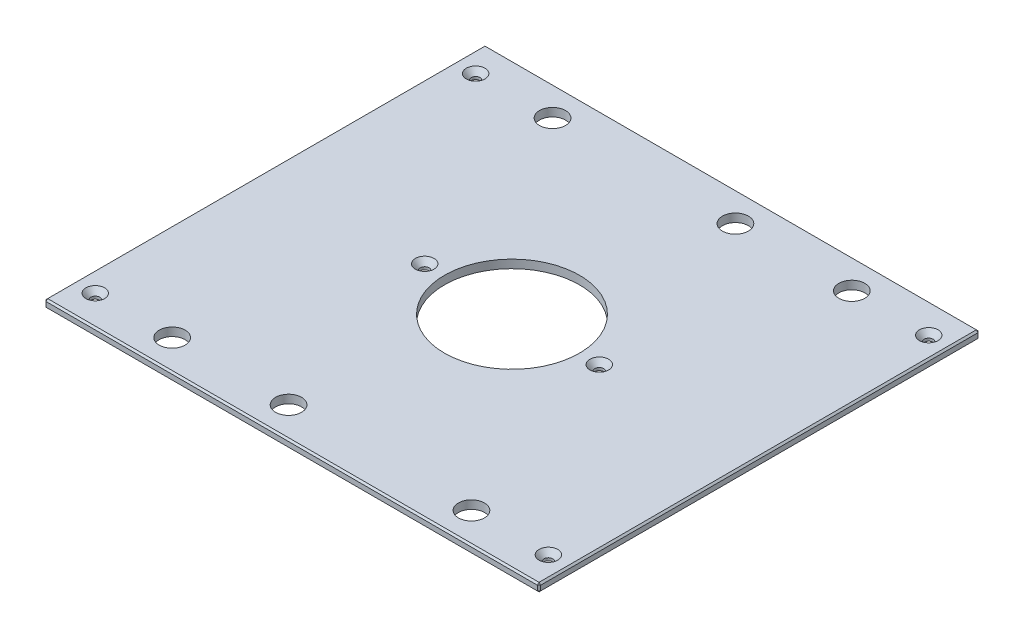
ISO-10303-21;
HEADER;
FILE_DESCRIPTION(('STEP AP214'),'2;1');
FILE_NAME('part.step','',(''),(''),'','','');
FILE_SCHEMA(('AUTOMOTIVE_DESIGN { 1 0 10303 214 1 1 1 1 }'));
ENDSEC;
DATA;
#1=APPLICATION_CONTEXT('core data for automotive mechanical design processes');
#2=APPLICATION_PROTOCOL_DEFINITION('international standard','automotive_design',2000,#1);
#3=PRODUCT_CONTEXT('',#1,'mechanical');
#4=PRODUCT('Part','Part','',(#3));
#5=PRODUCT_RELATED_PRODUCT_CATEGORY('part','',(#4));
#6=PRODUCT_DEFINITION_FORMATION('','',#4);
#7=PRODUCT_DEFINITION_CONTEXT('part definition',#1,'design');
#8=PRODUCT_DEFINITION('design','',#6,#7);
#9=PRODUCT_DEFINITION_SHAPE('','',#8);
#10=(LENGTH_UNIT() NAMED_UNIT(*) SI_UNIT(.MILLI.,.METRE.));
#11=(NAMED_UNIT(*) PLANE_ANGLE_UNIT() SI_UNIT($,.RADIAN.));
#12=(NAMED_UNIT(*) SI_UNIT($,.STERADIAN.) SOLID_ANGLE_UNIT());
#13=UNCERTAINTY_MEASURE_WITH_UNIT(LENGTH_MEASURE(1.E-05),#10,'distance_accuracy_value','');
#14=(GEOMETRIC_REPRESENTATION_CONTEXT(3) GLOBAL_UNCERTAINTY_ASSIGNED_CONTEXT((#13)) GLOBAL_UNIT_ASSIGNED_CONTEXT((#10,
#11,#12)) REPRESENTATION_CONTEXT('',''));
#15=CARTESIAN_POINT('',(0.,0.,0.));
#16=DIRECTION('',(0.,0.,1.));
#17=DIRECTION('',(1.,0.,0.));
#18=AXIS2_PLACEMENT_3D('',#15,#16,#17);
#19=CARTESIAN_POINT('',(-188.9125,6.35,-168.275));
#20=DIRECTION('',(1.,0.,0.));
#21=DIRECTION('',(0.,0.,-1.));
#22=AXIS2_PLACEMENT_3D('',#19,#20,#21);
#23=PLANE('',#22);
#24=DIRECTION('',(0.,0.,-1.));
#25=VECTOR('',#24,1.);
#26=CARTESIAN_POINT('',(-188.9125,5.08000000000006,-168.275));
#27=LINE('',#26,#25);
#28=CARTESIAN_POINT('',(-188.9125,5.08000000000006,167.005));
#29=VERTEX_POINT('',#28);
#30=CARTESIAN_POINT('',(-188.9125,5.08000000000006,-167.005));
#31=VERTEX_POINT('',#30);
#32=EDGE_CURVE('E134',#29,#31,#27,.T.);
#33=ORIENTED_EDGE('',*,*,#32,.T.);
#34=DIRECTION('',(0.,-1.,0.));
#35=VECTOR('',#34,1.);
#36=CARTESIAN_POINT('',(-188.9125,6.35,-167.005));
#37=LINE('',#36,#35);
#38=CARTESIAN_POINT('',(-188.9125,1.26999999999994,-167.005));
#39=VERTEX_POINT('',#38);
#40=EDGE_CURVE('E130',#31,#39,#37,.T.);
#41=ORIENTED_EDGE('',*,*,#40,.T.);
#42=DIRECTION('',(0.,0.,1.));
#43=VECTOR('',#42,1.);
#44=CARTESIAN_POINT('',(-188.9125,1.26999999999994,-168.275));
#45=LINE('',#44,#43);
#46=CARTESIAN_POINT('',(-188.9125,1.26999999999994,167.005));
#47=VERTEX_POINT('',#46);
#48=EDGE_CURVE('E125',#39,#47,#45,.T.);
#49=ORIENTED_EDGE('',*,*,#48,.T.);
#50=DIRECTION('',(0.,1.,0.));
#51=VECTOR('',#50,1.);
#52=CARTESIAN_POINT('',(-188.9125,6.35,167.005));
#53=LINE('',#52,#51);
#54=EDGE_CURVE('E127',#47,#29,#53,.T.);
#55=ORIENTED_EDGE('',*,*,#54,.T.);
#56=EDGE_LOOP('',(#33,#41,#49,#55));
#57=FACE_BOUND('',#56,.T.);
#58=ADVANCED_FACE('F34',(#57),#23,.F.);
#59=CARTESIAN_POINT('',(-188.9125,6.35,168.275));
#60=DIRECTION('',(0.,0.,-1.));
#61=DIRECTION('',(-1.,0.,0.));
#62=AXIS2_PLACEMENT_3D('',#59,#60,#61);
#63=PLANE('',#62);
#64=DIRECTION('',(1.,0.,0.));
#65=VECTOR('',#64,1.);
#66=CARTESIAN_POINT('',(-188.9125,1.26999999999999,168.275));
#67=LINE('',#66,#65);
#68=CARTESIAN_POINT('',(-187.6425,1.26999999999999,168.275));
#69=VERTEX_POINT('',#68);
#70=CARTESIAN_POINT('',(187.6425,1.26999999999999,168.275));
#71=VERTEX_POINT('',#70);
#72=EDGE_CURVE('E57',#69,#71,#67,.T.);
#73=ORIENTED_EDGE('',*,*,#72,.T.);
#74=DIRECTION('',(0.,1.,0.));
#75=VECTOR('',#74,1.);
#76=CARTESIAN_POINT('',(187.6425,6.35,168.275));
#77=LINE('',#76,#75);
#78=CARTESIAN_POINT('',(187.6425,5.08000000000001,168.275));
#79=VERTEX_POINT('',#78);
#80=EDGE_CURVE('E11',#71,#79,#77,.T.);
#81=ORIENTED_EDGE('',*,*,#80,.T.);
#82=DIRECTION('',(-1.,0.,0.));
#83=VECTOR('',#82,1.);
#84=CARTESIAN_POINT('',(-188.9125,5.08000000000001,168.275));
#85=LINE('',#84,#83);
#86=CARTESIAN_POINT('',(-187.6425,5.08000000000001,168.275));
#87=VERTEX_POINT('',#86);
#88=EDGE_CURVE('E43',#79,#87,#85,.T.);
#89=ORIENTED_EDGE('',*,*,#88,.T.);
#90=DIRECTION('',(0.,-1.,0.));
#91=VECTOR('',#90,1.);
#92=CARTESIAN_POINT('',(-187.6425,6.35,168.275));
#93=LINE('',#92,#91);
#94=EDGE_CURVE('E290',#87,#69,#93,.T.);
#95=ORIENTED_EDGE('',*,*,#94,.T.);
#96=EDGE_LOOP('',(#73,#81,#89,#95));
#97=FACE_BOUND('',#96,.T.);
#98=ADVANCED_FACE('F359',(#97),#63,.F.);
#99=CARTESIAN_POINT('',(188.9125,6.35,-168.275));
#100=DIRECTION('',(-1.,0.,0.));
#101=DIRECTION('',(0.,0.,1.));
#102=AXIS2_PLACEMENT_3D('',#99,#100,#101);
#103=PLANE('',#102);
#104=DIRECTION('',(0.,0.,-1.));
#105=VECTOR('',#104,1.);
#106=CARTESIAN_POINT('',(188.9125,1.26999999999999,-168.275));
#107=LINE('',#106,#105);
#108=CARTESIAN_POINT('',(188.9125,1.26999999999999,167.005));
#109=VERTEX_POINT('',#108);
#110=CARTESIAN_POINT('',(188.9125,1.26999999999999,-167.005));
#111=VERTEX_POINT('',#110);
#112=EDGE_CURVE('E285',#109,#111,#107,.T.);
#113=ORIENTED_EDGE('',*,*,#112,.T.);
#114=DIRECTION('',(0.,1.,0.));
#115=VECTOR('',#114,1.);
#116=CARTESIAN_POINT('',(188.9125,6.35,-167.005));
#117=LINE('',#116,#115);
#118=CARTESIAN_POINT('',(188.9125,5.08000000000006,-167.005));
#119=VERTEX_POINT('',#118);
#120=EDGE_CURVE('E287',#111,#119,#117,.T.);
#121=ORIENTED_EDGE('',*,*,#120,.T.);
#122=DIRECTION('',(0.,0.,1.));
#123=VECTOR('',#122,1.);
#124=CARTESIAN_POINT('',(188.9125,5.08000000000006,168.275));
#125=LINE('',#124,#123);
#126=CARTESIAN_POINT('',(188.9125,5.08000000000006,167.005));
#127=VERTEX_POINT('',#126);
#128=EDGE_CURVE('E283',#119,#127,#125,.T.);
#129=ORIENTED_EDGE('',*,*,#128,.T.);
#130=DIRECTION('',(0.,-1.,0.));
#131=VECTOR('',#130,1.);
#132=CARTESIAN_POINT('',(188.9125,6.35,167.005));
#133=LINE('',#132,#131);
#134=EDGE_CURVE('E281',#127,#109,#133,.T.);
#135=ORIENTED_EDGE('',*,*,#134,.T.);
#136=EDGE_LOOP('',(#113,#121,#129,#135));
#137=FACE_BOUND('',#136,.T.);
#138=ADVANCED_FACE('F346',(#137),#103,.F.);
#139=CARTESIAN_POINT('',(-188.9125,6.35,-168.275));
#140=DIRECTION('',(0.,0.,1.));
#141=DIRECTION('',(1.,0.,0.));
#142=AXIS2_PLACEMENT_3D('',#139,#140,#141);
#143=PLANE('',#142);
#144=DIRECTION('',(-1.,0.,0.));
#145=VECTOR('',#144,1.);
#146=CARTESIAN_POINT('',(-188.9125,1.26999999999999,-168.275));
#147=LINE('',#146,#145);
#148=CARTESIAN_POINT('',(187.6425,1.26999999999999,-168.275));
#149=VERTEX_POINT('',#148);
#150=CARTESIAN_POINT('',(-187.6425,1.26999999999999,-168.275));
#151=VERTEX_POINT('',#150);
#152=EDGE_CURVE('E257',#149,#151,#147,.T.);
#153=ORIENTED_EDGE('',*,*,#152,.T.);
#154=DIRECTION('',(0.,1.,0.));
#155=VECTOR('',#154,1.);
#156=CARTESIAN_POINT('',(-187.6425,6.35,-168.275));
#157=LINE('',#156,#155);
#158=CARTESIAN_POINT('',(-187.6425,5.08000000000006,-168.275));
#159=VERTEX_POINT('',#158);
#160=EDGE_CURVE('E261',#151,#159,#157,.T.);
#161=ORIENTED_EDGE('',*,*,#160,.T.);
#162=DIRECTION('',(1.,0.,0.));
#163=VECTOR('',#162,1.);
#164=CARTESIAN_POINT('',(188.9125,5.08000000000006,-168.275));
#165=LINE('',#164,#163);
#166=CARTESIAN_POINT('',(187.6425,5.08000000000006,-168.275));
#167=VERTEX_POINT('',#166);
#168=EDGE_CURVE('E259',#159,#167,#165,.T.);
#169=ORIENTED_EDGE('',*,*,#168,.T.);
#170=DIRECTION('',(0.,-1.,0.));
#171=VECTOR('',#170,1.);
#172=CARTESIAN_POINT('',(187.6425,6.35,-168.275));
#173=LINE('',#172,#171);
#174=EDGE_CURVE('E255',#167,#149,#173,.T.);
#175=ORIENTED_EDGE('',*,*,#174,.T.);
#176=EDGE_LOOP('',(#153,#161,#169,#175));
#177=FACE_BOUND('',#176,.T.);
#178=ADVANCED_FACE('F320',(#177),#143,.F.);
#179=CARTESIAN_POINT('',(0.,6.35,0.));
#180=DIRECTION('',(0.,1.,0.));
#181=DIRECTION('',(0.,0.,1.));
#182=AXIS2_PLACEMENT_3D('',#179,#180,#181);
#183=PLANE('',#182);
#184=CARTESIAN_POINT('',(173.0375,6.35,-145.25498));
#185=DIRECTION('',(0.,1.,0.));
#186=DIRECTION('',(0.,0.,1.));
#187=AXIS2_PLACEMENT_3D('',#184,#185,#186);
#188=CIRCLE('',#187,7.13739999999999);
#189=CARTESIAN_POINT('',(173.0375,6.35,-138.11758));
#190=VERTEX_POINT('',#189);
#191=EDGE_CURVE('E783',#190,#190,#188,.T.);
#192=ORIENTED_EDGE('',*,*,#191,.F.);
#193=EDGE_LOOP('',(#192));
#194=FACE_BOUND('',#193,.T.);
#195=CARTESIAN_POINT('',(173.0375,6.35,145.25498));
#196=DIRECTION('',(0.,1.,0.));
#197=DIRECTION('',(0.,0.,1.));
#198=AXIS2_PLACEMENT_3D('',#195,#196,#197);
#199=CIRCLE('',#198,7.13739999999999);
#200=CARTESIAN_POINT('',(173.0375,6.35,152.39238));
#201=VERTEX_POINT('',#200);
#202=EDGE_CURVE('E787',#201,#201,#199,.T.);
#203=ORIENTED_EDGE('',*,*,#202,.F.);
#204=EDGE_LOOP('',(#203));
#205=FACE_BOUND('',#204,.T.);
#206=CARTESIAN_POINT('',(-173.0375,6.35,145.25498));
#207=DIRECTION('',(0.,1.,0.));
#208=DIRECTION('',(0.,0.,1.));
#209=AXIS2_PLACEMENT_3D('',#206,#207,#208);
#210=CIRCLE('',#209,7.13739999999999);
#211=CARTESIAN_POINT('',(-173.0375,6.35,152.39238));
#212=VERTEX_POINT('',#211);
#213=EDGE_CURVE('E791',#212,#212,#210,.T.);
#214=ORIENTED_EDGE('',*,*,#213,.F.);
#215=EDGE_LOOP('',(#214));
#216=FACE_BOUND('',#215,.T.);
#217=CARTESIAN_POINT('',(-66.675,6.35,0.));
#218=DIRECTION('',(0.,1.,0.));
#219=DIRECTION('',(0.,0.,1.));
#220=AXIS2_PLACEMENT_3D('',#217,#218,#219);
#221=CIRCLE('',#220,7.1374);
#222=CARTESIAN_POINT('',(-66.675,6.35,7.1374));
#223=VERTEX_POINT('',#222);
#224=EDGE_CURVE('E795',#223,#223,#221,.T.);
#225=ORIENTED_EDGE('',*,*,#224,.F.);
#226=EDGE_LOOP('',(#225));
#227=FACE_BOUND('',#226,.T.);
#228=CARTESIAN_POINT('',(66.675,6.35,0.));
#229=DIRECTION('',(0.,1.,0.));
#230=DIRECTION('',(0.,0.,1.));
#231=AXIS2_PLACEMENT_3D('',#228,#229,#230);
#232=CIRCLE('',#231,7.1374);
#233=CARTESIAN_POINT('',(66.675,6.35,7.1374));
#234=VERTEX_POINT('',#233);
#235=EDGE_CURVE('E799',#234,#234,#232,.T.);
#236=ORIENTED_EDGE('',*,*,#235,.F.);
#237=EDGE_LOOP('',(#236));
#238=FACE_BOUND('',#237,.T.);
#239=CARTESIAN_POINT('',(-173.0375,6.35,-145.25498));
#240=DIRECTION('',(0.,1.,0.));
#241=DIRECTION('',(0.,0.,1.));
#242=AXIS2_PLACEMENT_3D('',#239,#240,#241);
#243=CIRCLE('',#242,7.13739999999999);
#244=CARTESIAN_POINT('',(-173.0375,6.35,-138.11758));
#245=VERTEX_POINT('',#244);
#246=EDGE_CURVE('E802',#245,#245,#243,.T.);
#247=ORIENTED_EDGE('',*,*,#246,.F.);
#248=EDGE_LOOP('',(#247));
#249=FACE_BOUND('',#248,.T.);
#250=DIRECTION('',(0.,0.,-1.));
#251=VECTOR('',#250,1.);
#252=CARTESIAN_POINT('',(187.6425,6.35,-168.275));
#253=LINE('',#252,#251);
#254=CARTESIAN_POINT('',(187.6425,6.35,167.005));
#255=VERTEX_POINT('',#254);
#256=CARTESIAN_POINT('',(187.6425,6.35,-167.005));
#257=VERTEX_POINT('',#256);
#258=EDGE_CURVE('E268',#255,#257,#253,.T.);
#259=ORIENTED_EDGE('',*,*,#258,.T.);
#260=DIRECTION('',(-1.,0.,0.));
#261=VECTOR('',#260,1.);
#262=CARTESIAN_POINT('',(-188.9125,6.35,-167.005));
#263=LINE('',#262,#261);
#264=CARTESIAN_POINT('',(-187.6425,6.35,-167.005));
#265=VERTEX_POINT('',#264);
#266=EDGE_CURVE('E270',#257,#265,#263,.T.);
#267=ORIENTED_EDGE('',*,*,#266,.T.);
#268=DIRECTION('',(0.,0.,1.));
#269=VECTOR('',#268,1.);
#270=CARTESIAN_POINT('',(-187.6425,6.35,168.275));
#271=LINE('',#270,#269);
#272=CARTESIAN_POINT('',(-187.6425,6.35,167.005));
#273=VERTEX_POINT('',#272);
#274=EDGE_CURVE('E266',#265,#273,#271,.T.);
#275=ORIENTED_EDGE('',*,*,#274,.T.);
#276=DIRECTION('',(1.,0.,0.));
#277=VECTOR('',#276,1.);
#278=CARTESIAN_POINT('',(188.9125,6.35,167.005));
#279=LINE('',#278,#277);
#280=EDGE_CURVE('E264',#273,#255,#279,.T.);
#281=ORIENTED_EDGE('',*,*,#280,.T.);
#282=EDGE_LOOP('',(#259,#267,#275,#281));
#283=FACE_BOUND('',#282,.T.);
#284=CARTESIAN_POINT('',(114.3,6.35,-145.25498));
#285=DIRECTION('',(0.,1.,0.));
#286=DIRECTION('',(0.,0.,1.));
#287=AXIS2_PLACEMENT_3D('',#284,#285,#286);
#288=CIRCLE('',#287,9.921875);
#289=CARTESIAN_POINT('',(114.3,6.35,-135.333105));
#290=VERTEX_POINT('',#289);
#291=EDGE_CURVE('E203',#290,#290,#288,.T.);
#292=ORIENTED_EDGE('',*,*,#291,.F.);
#293=EDGE_LOOP('',(#292));
#294=FACE_BOUND('',#293,.T.);
#295=CARTESIAN_POINT('',(-114.3,6.35,-145.25498));
#296=DIRECTION('',(0.,1.,0.));
#297=DIRECTION('',(0.,0.,1.));
#298=AXIS2_PLACEMENT_3D('',#295,#296,#297);
#299=CIRCLE('',#298,9.921875);
#300=CARTESIAN_POINT('',(-114.3,6.35,-135.333105));
#301=VERTEX_POINT('',#300);
#302=EDGE_CURVE('E213',#301,#301,#299,.T.);
#303=ORIENTED_EDGE('',*,*,#302,.F.);
#304=EDGE_LOOP('',(#303));
#305=FACE_BOUND('',#304,.T.);
#306=CARTESIAN_POINT('',(114.3,6.35,145.25498));
#307=DIRECTION('',(0.,1.,0.));
#308=DIRECTION('',(0.,0.,1.));
#309=AXIS2_PLACEMENT_3D('',#306,#307,#308);
#310=CIRCLE('',#309,9.921875);
#311=CARTESIAN_POINT('',(114.3,6.35,155.176855));
#312=VERTEX_POINT('',#311);
#313=EDGE_CURVE('E224',#312,#312,#310,.T.);
#314=ORIENTED_EDGE('',*,*,#313,.F.);
#315=EDGE_LOOP('',(#314));
#316=FACE_BOUND('',#315,.T.);
#317=CARTESIAN_POINT('',(-114.3,6.35,145.25498));
#318=DIRECTION('',(0.,1.,0.));
#319=DIRECTION('',(0.,0.,1.));
#320=AXIS2_PLACEMENT_3D('',#317,#318,#319);
#321=CIRCLE('',#320,9.921875);
#322=CARTESIAN_POINT('',(-114.3,6.35,155.176855));
#323=VERTEX_POINT('',#322);
#324=EDGE_CURVE('E230',#323,#323,#321,.T.);
#325=ORIENTED_EDGE('',*,*,#324,.F.);
#326=EDGE_LOOP('',(#325));
#327=FACE_BOUND('',#326,.T.);
#328=CARTESIAN_POINT('',(25.4,6.35,-145.25498));
#329=DIRECTION('',(0.,1.,0.));
#330=DIRECTION('',(0.,0.,1.));
#331=AXIS2_PLACEMENT_3D('',#328,#329,#330);
#332=CIRCLE('',#331,9.921875);
#333=CARTESIAN_POINT('',(25.4,6.35,-135.333105));
#334=VERTEX_POINT('',#333);
#335=EDGE_CURVE('E236',#334,#334,#332,.T.);
#336=ORIENTED_EDGE('',*,*,#335,.F.);
#337=EDGE_LOOP('',(#336));
#338=FACE_BOUND('',#337,.T.);
#339=CARTESIAN_POINT('',(-25.4,6.35,145.25498));
#340=DIRECTION('',(0.,1.,0.));
#341=DIRECTION('',(0.,0.,1.));
#342=AXIS2_PLACEMENT_3D('',#339,#340,#341);
#343=CIRCLE('',#342,9.921875);
#344=CARTESIAN_POINT('',(-25.4,6.35,155.176855));
#345=VERTEX_POINT('',#344);
#346=EDGE_CURVE('E242',#345,#345,#343,.T.);
#347=ORIENTED_EDGE('',*,*,#346,.F.);
#348=EDGE_LOOP('',(#347));
#349=FACE_BOUND('',#348,.T.);
#350=CARTESIAN_POINT('',(0.,6.35,0.));
#351=DIRECTION('',(0.,1.,0.));
#352=DIRECTION('',(0.,0.,1.));
#353=AXIS2_PLACEMENT_3D('',#350,#351,#352);
#354=CIRCLE('',#353,51.562);
#355=CARTESIAN_POINT('',(0.,6.35,51.562));
#356=VERTEX_POINT('',#355);
#357=EDGE_CURVE('E248',#356,#356,#354,.T.);
#358=ORIENTED_EDGE('',*,*,#357,.F.);
#359=EDGE_LOOP('',(#358));
#360=FACE_BOUND('',#359,.T.);
#361=ADVANCED_FACE('F368',(#194,#205,#216,#227,#238,#249,#283,#294,#305,#316,#327,#338,#349,
#360),#183,.T.);
#362=CARTESIAN_POINT('',(0.,0.,0.));
#363=DIRECTION('',(0.,1.,0.));
#364=DIRECTION('',(0.,0.,1.));
#365=AXIS2_PLACEMENT_3D('',#362,#363,#364);
#366=PLANE('',#365);
#367=CARTESIAN_POINT('',(173.0375,0.,-145.25498));
#368=DIRECTION('',(0.,1.,0.));
#369=DIRECTION('',(0.,0.,1.));
#370=AXIS2_PLACEMENT_3D('',#367,#368,#369);
#371=CIRCLE('',#370,3.3782);
#372=CARTESIAN_POINT('',(173.0375,0.,-141.87678));
#373=VERTEX_POINT('',#372);
#374=EDGE_CURVE('E836',#373,#373,#371,.T.);
#375=ORIENTED_EDGE('',*,*,#374,.T.);
#376=EDGE_LOOP('',(#375));
#377=FACE_BOUND('',#376,.T.);
#378=CARTESIAN_POINT('',(173.0375,0.,145.25498));
#379=DIRECTION('',(0.,1.,0.));
#380=DIRECTION('',(0.,0.,1.));
#381=AXIS2_PLACEMENT_3D('',#378,#379,#380);
#382=CIRCLE('',#381,3.3782);
#383=CARTESIAN_POINT('',(173.0375,0.,148.63318));
#384=VERTEX_POINT('',#383);
#385=EDGE_CURVE('E829',#384,#384,#382,.T.);
#386=ORIENTED_EDGE('',*,*,#385,.T.);
#387=EDGE_LOOP('',(#386));
#388=FACE_BOUND('',#387,.T.);
#389=CARTESIAN_POINT('',(-173.0375,0.,145.25498));
#390=DIRECTION('',(0.,1.,0.));
#391=DIRECTION('',(0.,0.,1.));
#392=AXIS2_PLACEMENT_3D('',#389,#390,#391);
#393=CIRCLE('',#392,3.3782);
#394=CARTESIAN_POINT('',(-173.0375,0.,148.63318));
#395=VERTEX_POINT('',#394);
#396=EDGE_CURVE('E822',#395,#395,#393,.T.);
#397=ORIENTED_EDGE('',*,*,#396,.T.);
#398=EDGE_LOOP('',(#397));
#399=FACE_BOUND('',#398,.T.);
#400=CARTESIAN_POINT('',(-66.675,0.,0.));
#401=DIRECTION('',(0.,1.,0.));
#402=DIRECTION('',(0.,0.,1.));
#403=AXIS2_PLACEMENT_3D('',#400,#401,#402);
#404=CIRCLE('',#403,3.3782);
#405=CARTESIAN_POINT('',(-66.675,0.,3.3782));
#406=VERTEX_POINT('',#405);
#407=EDGE_CURVE('E815',#406,#406,#404,.T.);
#408=ORIENTED_EDGE('',*,*,#407,.T.);
#409=EDGE_LOOP('',(#408));
#410=FACE_BOUND('',#409,.T.);
#411=CARTESIAN_POINT('',(66.675,0.,0.));
#412=DIRECTION('',(0.,1.,0.));
#413=DIRECTION('',(0.,0.,1.));
#414=AXIS2_PLACEMENT_3D('',#411,#412,#413);
#415=CIRCLE('',#414,3.3782);
#416=CARTESIAN_POINT('',(66.675,0.,3.3782));
#417=VERTEX_POINT('',#416);
#418=EDGE_CURVE('E805',#417,#417,#415,.T.);
#419=ORIENTED_EDGE('',*,*,#418,.T.);
#420=EDGE_LOOP('',(#419));
#421=FACE_BOUND('',#420,.T.);
#422=CARTESIAN_POINT('',(-173.0375,0.,-145.25498));
#423=DIRECTION('',(0.,1.,0.));
#424=DIRECTION('',(0.,0.,1.));
#425=AXIS2_PLACEMENT_3D('',#422,#423,#424);
#426=CIRCLE('',#425,3.3782);
#427=CARTESIAN_POINT('',(-173.0375,0.,-141.87678));
#428=VERTEX_POINT('',#427);
#429=EDGE_CURVE('E216',#428,#428,#426,.T.);
#430=ORIENTED_EDGE('',*,*,#429,.T.);
#431=EDGE_LOOP('',(#430));
#432=FACE_BOUND('',#431,.T.);
#433=DIRECTION('',(0.,0.,-1.));
#434=VECTOR('',#433,1.);
#435=CARTESIAN_POINT('',(-187.6425,0.,0.));
#436=LINE('',#435,#434);
#437=CARTESIAN_POINT('',(-187.6425,0.,167.005));
#438=VERTEX_POINT('',#437);
#439=CARTESIAN_POINT('',(-187.6425,0.,-167.005));
#440=VERTEX_POINT('',#439);
#441=EDGE_CURVE('E157',#438,#440,#436,.T.);
#442=ORIENTED_EDGE('',*,*,#441,.T.);
#443=DIRECTION('',(1.,0.,0.));
#444=VECTOR('',#443,1.);
#445=CARTESIAN_POINT('',(0.,0.,-167.005));
#446=LINE('',#445,#444);
#447=CARTESIAN_POINT('',(187.6425,0.,-167.005));
#448=VERTEX_POINT('',#447);
#449=EDGE_CURVE('E278',#440,#448,#446,.T.);
#450=ORIENTED_EDGE('',*,*,#449,.T.);
#451=DIRECTION('',(0.,0.,1.));
#452=VECTOR('',#451,1.);
#453=CARTESIAN_POINT('',(187.6425,0.,0.));
#454=LINE('',#453,#452);
#455=CARTESIAN_POINT('',(187.6425,0.,167.005));
#456=VERTEX_POINT('',#455);
#457=EDGE_CURVE('E276',#448,#456,#454,.T.);
#458=ORIENTED_EDGE('',*,*,#457,.T.);
#459=DIRECTION('',(-1.,0.,0.));
#460=VECTOR('',#459,1.);
#461=CARTESIAN_POINT('',(0.,0.,167.005));
#462=LINE('',#461,#460);
#463=EDGE_CURVE('E273',#456,#438,#462,.T.);
#464=ORIENTED_EDGE('',*,*,#463,.T.);
#465=EDGE_LOOP('',(#442,#450,#458,#464));
#466=FACE_BOUND('',#465,.T.);
#467=CARTESIAN_POINT('',(114.3,0.,-145.25498));
#468=DIRECTION('',(0.,1.,0.));
#469=DIRECTION('',(0.,0.,1.));
#470=AXIS2_PLACEMENT_3D('',#467,#468,#469);
#471=CIRCLE('',#470,9.921875);
#472=CARTESIAN_POINT('',(114.3,0.,-135.333105));
#473=VERTEX_POINT('',#472);
#474=EDGE_CURVE('E208',#473,#473,#471,.T.);
#475=ORIENTED_EDGE('',*,*,#474,.T.);
#476=EDGE_LOOP('',(#475));
#477=FACE_BOUND('',#476,.T.);
#478=CARTESIAN_POINT('',(-114.3,0.,-145.25498));
#479=DIRECTION('',(0.,1.,0.));
#480=DIRECTION('',(0.,0.,1.));
#481=AXIS2_PLACEMENT_3D('',#478,#479,#480);
#482=CIRCLE('',#481,9.921875);
#483=CARTESIAN_POINT('',(-114.3,0.,-135.333105));
#484=VERTEX_POINT('',#483);
#485=EDGE_CURVE('E221',#484,#484,#482,.T.);
#486=ORIENTED_EDGE('',*,*,#485,.T.);
#487=EDGE_LOOP('',(#486));
#488=FACE_BOUND('',#487,.T.);
#489=CARTESIAN_POINT('',(114.3,0.,145.25498));
#490=DIRECTION('',(0.,1.,0.));
#491=DIRECTION('',(0.,0.,1.));
#492=AXIS2_PLACEMENT_3D('',#489,#490,#491);
#493=CIRCLE('',#492,9.921875);
#494=CARTESIAN_POINT('',(114.3,0.,155.176855));
#495=VERTEX_POINT('',#494);
#496=EDGE_CURVE('E227',#495,#495,#493,.T.);
#497=ORIENTED_EDGE('',*,*,#496,.T.);
#498=EDGE_LOOP('',(#497));
#499=FACE_BOUND('',#498,.T.);
#500=CARTESIAN_POINT('',(-114.3,0.,145.25498));
#501=DIRECTION('',(0.,1.,0.));
#502=DIRECTION('',(0.,0.,1.));
#503=AXIS2_PLACEMENT_3D('',#500,#501,#502);
#504=CIRCLE('',#503,9.921875);
#505=CARTESIAN_POINT('',(-114.3,0.,155.176855));
#506=VERTEX_POINT('',#505);
#507=EDGE_CURVE('E233',#506,#506,#504,.T.);
#508=ORIENTED_EDGE('',*,*,#507,.T.);
#509=EDGE_LOOP('',(#508));
#510=FACE_BOUND('',#509,.T.);
#511=CARTESIAN_POINT('',(25.4,0.,-145.25498));
#512=DIRECTION('',(0.,1.,0.));
#513=DIRECTION('',(0.,0.,1.));
#514=AXIS2_PLACEMENT_3D('',#511,#512,#513);
#515=CIRCLE('',#514,9.921875);
#516=CARTESIAN_POINT('',(25.4,0.,-135.333105));
#517=VERTEX_POINT('',#516);
#518=EDGE_CURVE('E239',#517,#517,#515,.T.);
#519=ORIENTED_EDGE('',*,*,#518,.T.);
#520=EDGE_LOOP('',(#519));
#521=FACE_BOUND('',#520,.T.);
#522=CARTESIAN_POINT('',(-25.4,0.,145.25498));
#523=DIRECTION('',(0.,1.,0.));
#524=DIRECTION('',(0.,0.,1.));
#525=AXIS2_PLACEMENT_3D('',#522,#523,#524);
#526=CIRCLE('',#525,9.921875);
#527=CARTESIAN_POINT('',(-25.4,0.,155.176855));
#528=VERTEX_POINT('',#527);
#529=EDGE_CURVE('E245',#528,#528,#526,.T.);
#530=ORIENTED_EDGE('',*,*,#529,.T.);
#531=EDGE_LOOP('',(#530));
#532=FACE_BOUND('',#531,.T.);
#533=CARTESIAN_POINT('',(0.,0.,0.));
#534=DIRECTION('',(0.,1.,0.));
#535=DIRECTION('',(0.,0.,1.));
#536=AXIS2_PLACEMENT_3D('',#533,#534,#535);
#537=CIRCLE('',#536,51.562);
#538=CARTESIAN_POINT('',(0.,0.,51.562));
#539=VERTEX_POINT('',#538);
#540=EDGE_CURVE('E146',#539,#539,#537,.T.);
#541=ORIENTED_EDGE('',*,*,#540,.T.);
#542=EDGE_LOOP('',(#541));
#543=FACE_BOUND('',#542,.T.);
#544=ADVANCED_FACE('F333',(#377,#388,#399,#410,#421,#432,#466,#477,#488,#499,#510,#521,#532,
#543),#366,.F.);
#545=CARTESIAN_POINT('',(0.,0.,0.));
#546=DIRECTION('',(0.,1.,0.));
#547=DIRECTION('',(0.,0.,1.));
#548=AXIS2_PLACEMENT_3D('',#545,#546,#547);
#549=CYLINDRICAL_SURFACE('',#548,51.562);
#550=ORIENTED_EDGE('',*,*,#540,.F.);
#551=EDGE_LOOP('',(#550));
#552=FACE_BOUND('',#551,.T.);
#553=ORIENTED_EDGE('',*,*,#357,.T.);
#554=EDGE_LOOP('',(#553));
#555=FACE_BOUND('',#554,.T.);
#556=ADVANCED_FACE('F720',(#552,#555),#549,.F.);
#557=CARTESIAN_POINT('',(-25.4,6.35,145.25498));
#558=DIRECTION('',(0.,1.,0.));
#559=DIRECTION('',(0.,0.,1.));
#560=AXIS2_PLACEMENT_3D('',#557,#558,#559);
#561=CYLINDRICAL_SURFACE('',#560,9.921875);
#562=ORIENTED_EDGE('',*,*,#529,.F.);
#563=EDGE_LOOP('',(#562));
#564=FACE_BOUND('',#563,.T.);
#565=ORIENTED_EDGE('',*,*,#346,.T.);
#566=EDGE_LOOP('',(#565));
#567=FACE_BOUND('',#566,.T.);
#568=ADVANCED_FACE('F711',(#564,#567),#561,.F.);
#569=CARTESIAN_POINT('',(25.4,6.35,-145.25498));
#570=DIRECTION('',(0.,1.,0.));
#571=DIRECTION('',(0.,0.,1.));
#572=AXIS2_PLACEMENT_3D('',#569,#570,#571);
#573=CYLINDRICAL_SURFACE('',#572,9.921875);
#574=ORIENTED_EDGE('',*,*,#518,.F.);
#575=EDGE_LOOP('',(#574));
#576=FACE_BOUND('',#575,.T.);
#577=ORIENTED_EDGE('',*,*,#335,.T.);
#578=EDGE_LOOP('',(#577));
#579=FACE_BOUND('',#578,.T.);
#580=ADVANCED_FACE('F702',(#576,#579),#573,.F.);
#581=CARTESIAN_POINT('',(-114.3,6.35,145.25498));
#582=DIRECTION('',(0.,1.,0.));
#583=DIRECTION('',(0.,0.,1.));
#584=AXIS2_PLACEMENT_3D('',#581,#582,#583);
#585=CYLINDRICAL_SURFACE('',#584,9.921875);
#586=ORIENTED_EDGE('',*,*,#507,.F.);
#587=EDGE_LOOP('',(#586));
#588=FACE_BOUND('',#587,.T.);
#589=ORIENTED_EDGE('',*,*,#324,.T.);
#590=EDGE_LOOP('',(#589));
#591=FACE_BOUND('',#590,.T.);
#592=ADVANCED_FACE('F693',(#588,#591),#585,.F.);
#593=CARTESIAN_POINT('',(114.3,6.35,145.25498));
#594=DIRECTION('',(0.,1.,0.));
#595=DIRECTION('',(0.,0.,1.));
#596=AXIS2_PLACEMENT_3D('',#593,#594,#595);
#597=CYLINDRICAL_SURFACE('',#596,9.921875);
#598=ORIENTED_EDGE('',*,*,#496,.F.);
#599=EDGE_LOOP('',(#598));
#600=FACE_BOUND('',#599,.T.);
#601=ORIENTED_EDGE('',*,*,#313,.T.);
#602=EDGE_LOOP('',(#601));
#603=FACE_BOUND('',#602,.T.);
#604=ADVANCED_FACE('F684',(#600,#603),#597,.F.);
#605=CARTESIAN_POINT('',(-114.3,6.35,-145.25498));
#606=DIRECTION('',(0.,1.,0.));
#607=DIRECTION('',(0.,0.,1.));
#608=AXIS2_PLACEMENT_3D('',#605,#606,#607);
#609=CYLINDRICAL_SURFACE('',#608,9.921875);
#610=ORIENTED_EDGE('',*,*,#485,.F.);
#611=EDGE_LOOP('',(#610));
#612=FACE_BOUND('',#611,.T.);
#613=ORIENTED_EDGE('',*,*,#302,.T.);
#614=EDGE_LOOP('',(#613));
#615=FACE_BOUND('',#614,.T.);
#616=ADVANCED_FACE('F674',(#612,#615),#609,.F.);
#617=CARTESIAN_POINT('',(114.3,6.35,-145.25498));
#618=DIRECTION('',(0.,1.,0.));
#619=DIRECTION('',(0.,0.,1.));
#620=AXIS2_PLACEMENT_3D('',#617,#618,#619);
#621=CYLINDRICAL_SURFACE('',#620,9.921875);
#622=ORIENTED_EDGE('',*,*,#474,.F.);
#623=EDGE_LOOP('',(#622));
#624=FACE_BOUND('',#623,.T.);
#625=ORIENTED_EDGE('',*,*,#291,.T.);
#626=EDGE_LOOP('',(#625));
#627=FACE_BOUND('',#626,.T.);
#628=ADVANCED_FACE('F377',(#624,#627),#621,.F.);
#629=CARTESIAN_POINT('',(188.9125,6.35,167.005));
#630=DIRECTION('',(-0.707106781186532,0.,-0.707106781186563));
#631=DIRECTION('',(0.,-1.,0.));
#632=AXIS2_PLACEMENT_3D('',#629,#630,#631);
#633=PLANE('',#632);
#634=DIRECTION('',(-0.707106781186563,0.,0.707106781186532));
#635=VECTOR('',#634,1.);
#636=CARTESIAN_POINT('',(188.9125,5.08000000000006,167.005));
#637=LINE('',#636,#635);
#638=EDGE_CURVE('E38',#79,#127,#637,.F.);
#639=ORIENTED_EDGE('',*,*,#638,.F.);
#640=ORIENTED_EDGE('',*,*,#80,.F.);
#641=DIRECTION('',(0.707106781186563,0.,-0.707106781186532));
#642=VECTOR('',#641,1.);
#643=CARTESIAN_POINT('',(188.2775,1.26999999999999,167.64));
#644=LINE('',#643,#642);
#645=EDGE_CURVE('E196',#109,#71,#644,.F.);
#646=ORIENTED_EDGE('',*,*,#645,.F.);
#647=ORIENTED_EDGE('',*,*,#134,.F.);
#648=EDGE_LOOP('',(#639,#640,#646,#647));
#649=FACE_BOUND('',#648,.T.);
#650=ADVANCED_FACE('F36',(#649),#633,.F.);
#651=CARTESIAN_POINT('',(188.9125,5.08000000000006,167.005));
#652=DIRECTION('',(0.577350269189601,0.577350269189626,0.577350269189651));
#653=DIRECTION('',(0.,-0.707106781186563,0.707106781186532));
#654=AXIS2_PLACEMENT_3D('',#651,#652,#653);
#655=PLANE('',#654);
#656=DIRECTION('',(0.,-0.707106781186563,0.707106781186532));
#657=VECTOR('',#656,1.);
#658=CARTESIAN_POINT('',(187.6425,5.715,167.64));
#659=LINE('',#658,#657);
#660=EDGE_CURVE('E192',#79,#255,#659,.F.);
#661=ORIENTED_EDGE('',*,*,#660,.F.);
#662=ORIENTED_EDGE('',*,*,#638,.T.);
#663=DIRECTION('',(-0.707106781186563,0.707106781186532,0.));
#664=VECTOR('',#663,1.);
#665=CARTESIAN_POINT('',(188.9125,5.08000000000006,167.005));
#666=LINE('',#665,#664);
#667=EDGE_CURVE('E194',#255,#127,#666,.F.);
#668=ORIENTED_EDGE('',*,*,#667,.F.);
#669=EDGE_LOOP('',(#661,#662,#668));
#670=FACE_BOUND('',#669,.T.);
#671=ADVANCED_FACE('F370',(#670),#655,.T.);
#672=CARTESIAN_POINT('',(187.6425,0.,167.005));
#673=DIRECTION('',(0.577350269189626,-0.577350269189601,0.577350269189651));
#674=DIRECTION('',(0.707106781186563,0.,-0.707106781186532));
#675=AXIS2_PLACEMENT_3D('',#672,#673,#674);
#676=PLANE('',#675);
#677=DIRECTION('',(-0.707106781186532,-0.707106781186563,0.));
#678=VECTOR('',#677,1.);
#679=CARTESIAN_POINT('',(187.6425,0.,167.005));
#680=LINE('',#679,#678);
#681=EDGE_CURVE('E186',#109,#456,#680,.T.);
#682=ORIENTED_EDGE('',*,*,#681,.F.);
#683=ORIENTED_EDGE('',*,*,#645,.T.);
#684=DIRECTION('',(0.,0.707106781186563,0.707106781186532));
#685=VECTOR('',#684,1.);
#686=CARTESIAN_POINT('',(187.6425,0.,167.005));
#687=LINE('',#686,#685);
#688=EDGE_CURVE('E189',#456,#71,#687,.T.);
#689=ORIENTED_EDGE('',*,*,#688,.F.);
#690=EDGE_LOOP('',(#682,#683,#689));
#691=FACE_BOUND('',#690,.T.);
#692=ADVANCED_FACE('F339',(#691),#676,.T.);
#693=CARTESIAN_POINT('',(187.6425,6.35,0.));
#694=DIRECTION('',(0.707106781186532,0.707106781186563,0.));
#695=DIRECTION('',(0.,0.,1.));
#696=AXIS2_PLACEMENT_3D('',#693,#694,#695);
#697=PLANE('',#696);
#698=ORIENTED_EDGE('',*,*,#667,.T.);
#699=ORIENTED_EDGE('',*,*,#128,.F.);
#700=DIRECTION('',(0.707106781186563,-0.707106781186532,0.));
#701=VECTOR('',#700,1.);
#702=CARTESIAN_POINT('',(188.2775,5.71500000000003,-167.005));
#703=LINE('',#702,#701);
#704=EDGE_CURVE('E181',#257,#119,#703,.T.);
#705=ORIENTED_EDGE('',*,*,#704,.F.);
#706=ORIENTED_EDGE('',*,*,#258,.F.);
#707=EDGE_LOOP('',(#698,#699,#705,#706));
#708=FACE_BOUND('',#707,.T.);
#709=ADVANCED_FACE('F356',(#708),#697,.T.);
#710=CARTESIAN_POINT('',(0.,6.35,167.005));
#711=DIRECTION('',(0.,0.707106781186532,0.707106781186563));
#712=DIRECTION('',(-1.,0.,0.));
#713=AXIS2_PLACEMENT_3D('',#710,#711,#712);
#714=PLANE('',#713);
#715=ORIENTED_EDGE('',*,*,#660,.T.);
#716=ORIENTED_EDGE('',*,*,#280,.F.);
#717=DIRECTION('',(0.,0.707106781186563,-0.707106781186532));
#718=VECTOR('',#717,1.);
#719=CARTESIAN_POINT('',(-187.6425,6.35,167.005));
#720=LINE('',#719,#718);
#721=EDGE_CURVE('E178',#87,#273,#720,.T.);
#722=ORIENTED_EDGE('',*,*,#721,.F.);
#723=ORIENTED_EDGE('',*,*,#88,.F.);
#724=EDGE_LOOP('',(#715,#716,#722,#723));
#725=FACE_BOUND('',#724,.T.);
#726=ADVANCED_FACE('F361',(#725),#714,.T.);
#727=CARTESIAN_POINT('',(-187.6425,6.35,168.275));
#728=DIRECTION('',(0.707106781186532,0.,-0.707106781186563));
#729=DIRECTION('',(0.,-1.,0.));
#730=AXIS2_PLACEMENT_3D('',#727,#728,#729);
#731=PLANE('',#730);
#732=DIRECTION('',(0.707106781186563,0.,0.707106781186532));
#733=VECTOR('',#732,1.);
#734=CARTESIAN_POINT('',(-188.9125,1.26999999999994,167.005));
#735=LINE('',#734,#733);
#736=EDGE_CURVE('E141',#69,#47,#735,.F.);
#737=ORIENTED_EDGE('',*,*,#736,.F.);
#738=ORIENTED_EDGE('',*,*,#94,.F.);
#739=DIRECTION('',(-0.707106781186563,0.,-0.707106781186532));
#740=VECTOR('',#739,1.);
#741=CARTESIAN_POINT('',(-188.2775,5.08000000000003,167.64));
#742=LINE('',#741,#740);
#743=EDGE_CURVE('E144',#29,#87,#742,.F.);
#744=ORIENTED_EDGE('',*,*,#743,.F.);
#745=ORIENTED_EDGE('',*,*,#54,.F.);
#746=EDGE_LOOP('',(#737,#738,#744,#745));
#747=FACE_BOUND('',#746,.T.);
#748=ADVANCED_FACE('F139',(#747),#731,.F.);
#749=CARTESIAN_POINT('',(-188.9125,1.26999999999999,168.275));
#750=DIRECTION('',(0.,0.707106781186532,-0.707106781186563));
#751=DIRECTION('',(1.,0.,0.));
#752=AXIS2_PLACEMENT_3D('',#749,#750,#751);
#753=PLANE('',#752);
#754=ORIENTED_EDGE('',*,*,#688,.T.);
#755=ORIENTED_EDGE('',*,*,#72,.F.);
#756=DIRECTION('',(0.,-0.707106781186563,-0.707106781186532));
#757=VECTOR('',#756,1.);
#758=CARTESIAN_POINT('',(-187.6425,0.634999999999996,167.64));
#759=LINE('',#758,#757);
#760=EDGE_CURVE('E154',#438,#69,#759,.F.);
#761=ORIENTED_EDGE('',*,*,#760,.F.);
#762=ORIENTED_EDGE('',*,*,#463,.F.);
#763=EDGE_LOOP('',(#754,#755,#761,#762));
#764=FACE_BOUND('',#763,.T.);
#765=ADVANCED_FACE('F338',(#764),#753,.F.);
#766=CARTESIAN_POINT('',(188.9125,1.26999999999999,-168.275));
#767=DIRECTION('',(-0.707106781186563,0.707106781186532,0.));
#768=DIRECTION('',(0.,0.,-1.));
#769=AXIS2_PLACEMENT_3D('',#766,#767,#768);
#770=PLANE('',#769);
#771=ORIENTED_EDGE('',*,*,#681,.T.);
#772=ORIENTED_EDGE('',*,*,#457,.F.);
#773=DIRECTION('',(0.707106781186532,0.707106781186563,0.));
#774=VECTOR('',#773,1.);
#775=CARTESIAN_POINT('',(187.6425,0.,-167.005));
#776=LINE('',#775,#774);
#777=EDGE_CURVE('E173',#111,#448,#776,.F.);
#778=ORIENTED_EDGE('',*,*,#777,.F.);
#779=ORIENTED_EDGE('',*,*,#112,.F.);
#780=EDGE_LOOP('',(#771,#772,#778,#779));
#781=FACE_BOUND('',#780,.T.);
#782=ADVANCED_FACE('F343',(#781),#770,.F.);
#783=CARTESIAN_POINT('',(187.6425,6.35,-168.275));
#784=DIRECTION('',(-0.707106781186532,0.,0.707106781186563));
#785=DIRECTION('',(0.,-1.,0.));
#786=AXIS2_PLACEMENT_3D('',#783,#784,#785);
#787=PLANE('',#786);
#788=DIRECTION('',(0.707106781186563,0.,0.707106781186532));
#789=VECTOR('',#788,1.);
#790=CARTESIAN_POINT('',(187.6425,5.08000000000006,-168.275));
#791=LINE('',#790,#789);
#792=EDGE_CURVE('E183',#119,#167,#791,.F.);
#793=ORIENTED_EDGE('',*,*,#792,.F.);
#794=ORIENTED_EDGE('',*,*,#120,.F.);
#795=DIRECTION('',(-0.707106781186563,0.,-0.707106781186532));
#796=VECTOR('',#795,1.);
#797=CARTESIAN_POINT('',(188.2775,1.26999999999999,-167.64));
#798=LINE('',#797,#796);
#799=EDGE_CURVE('E170',#149,#111,#798,.F.);
#800=ORIENTED_EDGE('',*,*,#799,.F.);
#801=ORIENTED_EDGE('',*,*,#174,.F.);
#802=EDGE_LOOP('',(#793,#794,#800,#801));
#803=FACE_BOUND('',#802,.T.);
#804=ADVANCED_FACE('F351',(#803),#787,.F.);
#805=CARTESIAN_POINT('',(187.6425,5.08000000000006,-168.275));
#806=DIRECTION('',(0.577350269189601,0.577350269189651,-0.577350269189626));
#807=DIRECTION('',(0.,0.707106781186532,0.707106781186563));
#808=AXIS2_PLACEMENT_3D('',#805,#806,#807);
#809=PLANE('',#808);
#810=ORIENTED_EDGE('',*,*,#704,.T.);
#811=ORIENTED_EDGE('',*,*,#792,.T.);
#812=DIRECTION('',(0.,0.707106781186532,0.707106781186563));
#813=VECTOR('',#812,1.);
#814=CARTESIAN_POINT('',(187.6425,5.08000000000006,-168.275));
#815=LINE('',#814,#813);
#816=EDGE_CURVE('E162',#257,#167,#815,.F.);
#817=ORIENTED_EDGE('',*,*,#816,.F.);
#818=EDGE_LOOP('',(#810,#811,#817));
#819=FACE_BOUND('',#818,.T.);
#820=ADVANCED_FACE('F409',(#819),#809,.T.);
#821=CARTESIAN_POINT('',(-187.6425,6.35,167.005));
#822=DIRECTION('',(-0.577350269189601,0.577350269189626,0.577350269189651));
#823=DIRECTION('',(0.,-0.707106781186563,0.707106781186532));
#824=AXIS2_PLACEMENT_3D('',#821,#822,#823);
#825=PLANE('',#824);
#826=ORIENTED_EDGE('',*,*,#743,.T.);
#827=ORIENTED_EDGE('',*,*,#721,.T.);
#828=DIRECTION('',(-0.707106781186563,-0.707106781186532,0.));
#829=VECTOR('',#828,1.);
#830=CARTESIAN_POINT('',(-187.6425,6.35,167.005));
#831=LINE('',#830,#829);
#832=EDGE_CURVE('E158',#29,#273,#831,.F.);
#833=ORIENTED_EDGE('',*,*,#832,.F.);
#834=EDGE_LOOP('',(#826,#827,#833));
#835=FACE_BOUND('',#834,.T.);
#836=ADVANCED_FACE('F363',(#835),#825,.T.);
#837=CARTESIAN_POINT('',(-188.9125,1.26999999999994,167.005));
#838=DIRECTION('',(-0.577350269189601,-0.577350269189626,0.577350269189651));
#839=DIRECTION('',(0.,-0.707106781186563,-0.707106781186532));
#840=AXIS2_PLACEMENT_3D('',#837,#838,#839);
#841=PLANE('',#840);
#842=ORIENTED_EDGE('',*,*,#760,.T.);
#843=ORIENTED_EDGE('',*,*,#736,.T.);
#844=DIRECTION('',(-0.707106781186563,0.707106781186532,0.));
#845=VECTOR('',#844,1.);
#846=CARTESIAN_POINT('',(-188.9125,1.26999999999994,167.005));
#847=LINE('',#846,#845);
#848=EDGE_CURVE('E151',#438,#47,#847,.T.);
#849=ORIENTED_EDGE('',*,*,#848,.F.);
#850=EDGE_LOOP('',(#842,#843,#849));
#851=FACE_BOUND('',#850,.T.);
#852=ADVANCED_FACE('F150',(#851),#841,.T.);
#853=CARTESIAN_POINT('',(187.6425,0.,-167.005));
#854=DIRECTION('',(0.577350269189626,-0.577350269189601,-0.577350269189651));
#855=DIRECTION('',(-0.707106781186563,0.,-0.707106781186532));
#856=AXIS2_PLACEMENT_3D('',#853,#854,#855);
#857=PLANE('',#856);
#858=ORIENTED_EDGE('',*,*,#799,.T.);
#859=ORIENTED_EDGE('',*,*,#777,.T.);
#860=DIRECTION('',(0.,-0.707106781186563,0.707106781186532));
#861=VECTOR('',#860,1.);
#862=CARTESIAN_POINT('',(187.6425,0.,-167.005));
#863=LINE('',#862,#861);
#864=EDGE_CURVE('E159',#149,#448,#863,.T.);
#865=ORIENTED_EDGE('',*,*,#864,.F.);
#866=EDGE_LOOP('',(#858,#859,#865));
#867=FACE_BOUND('',#866,.T.);
#868=ADVANCED_FACE('F401',(#867),#857,.T.);
#869=CARTESIAN_POINT('',(0.,6.35,-167.005));
#870=DIRECTION('',(0.,0.707106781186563,-0.707106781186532));
#871=DIRECTION('',(1.,0.,0.));
#872=AXIS2_PLACEMENT_3D('',#869,#870,#871);
#873=PLANE('',#872);
#874=ORIENTED_EDGE('',*,*,#816,.T.);
#875=ORIENTED_EDGE('',*,*,#168,.F.);
#876=DIRECTION('',(0.,-0.707106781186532,-0.707106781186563));
#877=VECTOR('',#876,1.);
#878=CARTESIAN_POINT('',(-187.6425,5.08000000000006,-168.275));
#879=LINE('',#878,#877);
#880=EDGE_CURVE('E164',#265,#159,#879,.T.);
#881=ORIENTED_EDGE('',*,*,#880,.F.);
#882=ORIENTED_EDGE('',*,*,#266,.F.);
#883=EDGE_LOOP('',(#874,#875,#881,#882));
#884=FACE_BOUND('',#883,.T.);
#885=ADVANCED_FACE('F315',(#884),#873,.T.);
#886=CARTESIAN_POINT('',(-187.6425,6.35,0.));
#887=DIRECTION('',(-0.707106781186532,0.707106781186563,0.));
#888=DIRECTION('',(0.,0.,-1.));
#889=AXIS2_PLACEMENT_3D('',#886,#887,#888);
#890=PLANE('',#889);
#891=ORIENTED_EDGE('',*,*,#832,.T.);
#892=ORIENTED_EDGE('',*,*,#274,.F.);
#893=DIRECTION('',(0.707106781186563,0.707106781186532,0.));
#894=VECTOR('',#893,1.);
#895=CARTESIAN_POINT('',(-188.2775,5.71500000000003,-167.005));
#896=LINE('',#895,#894);
#897=EDGE_CURVE('E304',#31,#265,#896,.T.);
#898=ORIENTED_EDGE('',*,*,#897,.F.);
#899=ORIENTED_EDGE('',*,*,#32,.F.);
#900=EDGE_LOOP('',(#891,#892,#898,#899));
#901=FACE_BOUND('',#900,.T.);
#902=ADVANCED_FACE('F366',(#901),#890,.T.);
#903=CARTESIAN_POINT('',(-188.9125,1.26999999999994,-168.275));
#904=DIRECTION('',(0.707106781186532,0.707106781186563,0.));
#905=DIRECTION('',(0.,0.,1.));
#906=AXIS2_PLACEMENT_3D('',#903,#904,#905);
#907=PLANE('',#906);
#908=ORIENTED_EDGE('',*,*,#848,.T.);
#909=ORIENTED_EDGE('',*,*,#48,.F.);
#910=DIRECTION('',(0.707106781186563,-0.707106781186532,0.));
#911=VECTOR('',#910,1.);
#912=CARTESIAN_POINT('',(-188.9125,1.26999999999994,-167.005));
#913=LINE('',#912,#911);
#914=EDGE_CURVE('E301',#440,#39,#913,.F.);
#915=ORIENTED_EDGE('',*,*,#914,.F.);
#916=ORIENTED_EDGE('',*,*,#441,.F.);
#917=EDGE_LOOP('',(#908,#909,#915,#916));
#918=FACE_BOUND('',#917,.T.);
#919=ADVANCED_FACE('F156',(#918),#907,.F.);
#920=CARTESIAN_POINT('',(-188.9125,1.26999999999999,-168.275));
#921=DIRECTION('',(0.,0.707106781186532,0.707106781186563));
#922=DIRECTION('',(-1.,0.,0.));
#923=AXIS2_PLACEMENT_3D('',#920,#921,#922);
#924=PLANE('',#923);
#925=ORIENTED_EDGE('',*,*,#864,.T.);
#926=ORIENTED_EDGE('',*,*,#449,.F.);
#927=DIRECTION('',(0.,0.707106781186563,-0.707106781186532));
#928=VECTOR('',#927,1.);
#929=CARTESIAN_POINT('',(-187.6425,0.634999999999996,-167.64));
#930=LINE('',#929,#928);
#931=EDGE_CURVE('E298',#151,#440,#930,.F.);
#932=ORIENTED_EDGE('',*,*,#931,.F.);
#933=ORIENTED_EDGE('',*,*,#152,.F.);
#934=EDGE_LOOP('',(#925,#926,#932,#933));
#935=FACE_BOUND('',#934,.T.);
#936=ADVANCED_FACE('F330',(#935),#924,.F.);
#937=CARTESIAN_POINT('',(-187.6425,5.08000000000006,-168.275));
#938=DIRECTION('',(-0.577350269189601,0.577350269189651,-0.577350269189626));
#939=DIRECTION('',(0.,0.707106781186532,0.707106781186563));
#940=AXIS2_PLACEMENT_3D('',#937,#938,#939);
#941=PLANE('',#940);
#942=ORIENTED_EDGE('',*,*,#897,.T.);
#943=ORIENTED_EDGE('',*,*,#880,.T.);
#944=DIRECTION('',(0.707106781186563,0.,-0.707106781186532));
#945=VECTOR('',#944,1.);
#946=CARTESIAN_POINT('',(-187.6425,5.08000000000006,-168.275));
#947=LINE('',#946,#945);
#948=EDGE_CURVE('E296',#31,#159,#947,.T.);
#949=ORIENTED_EDGE('',*,*,#948,.F.);
#950=EDGE_LOOP('',(#942,#943,#949));
#951=FACE_BOUND('',#950,.T.);
#952=ADVANCED_FACE('F310',(#951),#941,.T.);
#953=CARTESIAN_POINT('',(-188.9125,1.26999999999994,-167.005));
#954=DIRECTION('',(-0.577350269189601,-0.577350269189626,-0.577350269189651));
#955=DIRECTION('',(0.,0.707106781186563,-0.707106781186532));
#956=AXIS2_PLACEMENT_3D('',#953,#954,#955);
#957=PLANE('',#956);
#958=ORIENTED_EDGE('',*,*,#931,.T.);
#959=ORIENTED_EDGE('',*,*,#914,.T.);
#960=DIRECTION('',(-0.707106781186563,0.,0.707106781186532));
#961=VECTOR('',#960,1.);
#962=CARTESIAN_POINT('',(-188.9125,1.26999999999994,-167.005));
#963=LINE('',#962,#961);
#964=EDGE_CURVE('E294',#151,#39,#963,.T.);
#965=ORIENTED_EDGE('',*,*,#964,.F.);
#966=EDGE_LOOP('',(#958,#959,#965));
#967=FACE_BOUND('',#966,.T.);
#968=ADVANCED_FACE('F327',(#967),#957,.T.);
#969=CARTESIAN_POINT('',(-188.9125,6.35,-167.005));
#970=DIRECTION('',(0.707106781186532,0.,0.707106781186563));
#971=DIRECTION('',(0.,-1.,0.));
#972=AXIS2_PLACEMENT_3D('',#969,#970,#971);
#973=PLANE('',#972);
#974=ORIENTED_EDGE('',*,*,#948,.T.);
#975=ORIENTED_EDGE('',*,*,#160,.F.);
#976=ORIENTED_EDGE('',*,*,#964,.T.);
#977=ORIENTED_EDGE('',*,*,#40,.F.);
#978=EDGE_LOOP('',(#974,#975,#976,#977));
#979=FACE_BOUND('',#978,.T.);
#980=ADVANCED_FACE('F325',(#979),#973,.F.);
#981=CARTESIAN_POINT('',(-173.0375,6.35,-145.25498));
#982=DIRECTION('',(0.,1.,0.));
#983=DIRECTION('',(0.,0.,1.));
#984=AXIS2_PLACEMENT_3D('',#981,#982,#983);
#985=CYLINDRICAL_SURFACE('',#984,3.3782);
#986=ORIENTED_EDGE('',*,*,#429,.F.);
#987=EDGE_LOOP('',(#986));
#988=FACE_BOUND('',#987,.T.);
#989=CARTESIAN_POINT('',(-173.0375,2.02553508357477,-145.25498));
#990=DIRECTION('',(0.,1.,0.));
#991=DIRECTION('',(0.,0.,1.));
#992=AXIS2_PLACEMENT_3D('',#989,#990,#991);
#993=CIRCLE('',#992,3.3782);
#994=CARTESIAN_POINT('',(-173.0375,2.02553508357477,-141.87678));
#995=VERTEX_POINT('',#994);
#996=EDGE_CURVE('E804',#995,#995,#993,.T.);
#997=ORIENTED_EDGE('',*,*,#996,.T.);
#998=EDGE_LOOP('',(#997));
#999=FACE_BOUND('',#998,.T.);
#1000=ADVANCED_FACE('F388',(#988,#999),#985,.F.);
#1001=CARTESIAN_POINT('',(-173.0375,6.35,-145.25498));
#1002=DIRECTION('',(0.,1.,0.));
#1003=DIRECTION('',(0.,0.,1.));
#1004=AXIS2_PLACEMENT_3D('',#1001,#1002,#1003);
#1005=CONICAL_SURFACE('',#1004,7.13739999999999,0.715584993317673);
#1006=ORIENTED_EDGE('',*,*,#996,.F.);
#1007=EDGE_LOOP('',(#1006));
#1008=FACE_BOUND('',#1007,.T.);
#1009=ORIENTED_EDGE('',*,*,#246,.T.);
#1010=EDGE_LOOP('',(#1009));
#1011=FACE_BOUND('',#1010,.T.);
#1012=ADVANCED_FACE('F498',(#1008,#1011),#1005,.F.);
#1013=CARTESIAN_POINT('',(66.675,6.35,0.));
#1014=DIRECTION('',(0.,1.,0.));
#1015=DIRECTION('',(0.,0.,1.));
#1016=AXIS2_PLACEMENT_3D('',#1013,#1014,#1015);
#1017=CYLINDRICAL_SURFACE('',#1016,3.3782);
#1018=ORIENTED_EDGE('',*,*,#418,.F.);
#1019=EDGE_LOOP('',(#1018));
#1020=FACE_BOUND('',#1019,.T.);
#1021=CARTESIAN_POINT('',(66.675,2.02553508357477,0.));
#1022=DIRECTION('',(0.,1.,0.));
#1023=DIRECTION('',(0.,0.,1.));
#1024=AXIS2_PLACEMENT_3D('',#1021,#1022,#1023);
#1025=CIRCLE('',#1024,3.3782);
#1026=CARTESIAN_POINT('',(66.675,2.02553508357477,3.3782));
#1027=VERTEX_POINT('',#1026);
#1028=EDGE_CURVE('E809',#1027,#1027,#1025,.T.);
#1029=ORIENTED_EDGE('',*,*,#1028,.T.);
#1030=EDGE_LOOP('',(#1029));
#1031=FACE_BOUND('',#1030,.T.);
#1032=ADVANCED_FACE('F507',(#1020,#1031),#1017,.F.);
#1033=CARTESIAN_POINT('',(66.675,6.35,0.));
#1034=DIRECTION('',(0.,1.,0.));
#1035=DIRECTION('',(0.,0.,1.));
#1036=AXIS2_PLACEMENT_3D('',#1033,#1034,#1035);
#1037=CONICAL_SURFACE('',#1036,7.1374,0.715584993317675);
#1038=ORIENTED_EDGE('',*,*,#1028,.F.);
#1039=EDGE_LOOP('',(#1038));
#1040=FACE_BOUND('',#1039,.T.);
#1041=ORIENTED_EDGE('',*,*,#235,.T.);
#1042=EDGE_LOOP('',(#1041));
#1043=FACE_BOUND('',#1042,.T.);
#1044=ADVANCED_FACE('F515',(#1040,#1043),#1037,.F.);
#1045=CARTESIAN_POINT('',(-66.675,6.35,0.));
#1046=DIRECTION('',(0.,1.,0.));
#1047=DIRECTION('',(0.,0.,1.));
#1048=AXIS2_PLACEMENT_3D('',#1045,#1046,#1047);
#1049=CYLINDRICAL_SURFACE('',#1048,3.3782);
#1050=ORIENTED_EDGE('',*,*,#407,.F.);
#1051=EDGE_LOOP('',(#1050));
#1052=FACE_BOUND('',#1051,.T.);
#1053=CARTESIAN_POINT('',(-66.675,2.02553508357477,0.));
#1054=DIRECTION('',(0.,1.,0.));
#1055=DIRECTION('',(0.,0.,1.));
#1056=AXIS2_PLACEMENT_3D('',#1053,#1054,#1055);
#1057=CIRCLE('',#1056,3.3782);
#1058=CARTESIAN_POINT('',(-66.675,2.02553508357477,3.3782));
#1059=VERTEX_POINT('',#1058);
#1060=EDGE_CURVE('E818',#1059,#1059,#1057,.T.);
#1061=ORIENTED_EDGE('',*,*,#1060,.T.);
#1062=EDGE_LOOP('',(#1061));
#1063=FACE_BOUND('',#1062,.T.);
#1064=ADVANCED_FACE('F523',(#1052,#1063),#1049,.F.);
#1065=CARTESIAN_POINT('',(-66.675,6.35,0.));
#1066=DIRECTION('',(0.,1.,0.));
#1067=DIRECTION('',(0.,0.,1.));
#1068=AXIS2_PLACEMENT_3D('',#1065,#1066,#1067);
#1069=CONICAL_SURFACE('',#1068,7.1374,0.715584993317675);
#1070=ORIENTED_EDGE('',*,*,#1060,.F.);
#1071=EDGE_LOOP('',(#1070));
#1072=FACE_BOUND('',#1071,.T.);
#1073=ORIENTED_EDGE('',*,*,#224,.T.);
#1074=EDGE_LOOP('',(#1073));
#1075=FACE_BOUND('',#1074,.T.);
#1076=ADVANCED_FACE('F531',(#1072,#1075),#1069,.F.);
#1077=CARTESIAN_POINT('',(-173.0375,6.35,145.25498));
#1078=DIRECTION('',(0.,1.,0.));
#1079=DIRECTION('',(0.,0.,1.));
#1080=AXIS2_PLACEMENT_3D('',#1077,#1078,#1079);
#1081=CYLINDRICAL_SURFACE('',#1080,3.3782);
#1082=ORIENTED_EDGE('',*,*,#396,.F.);
#1083=EDGE_LOOP('',(#1082));
#1084=FACE_BOUND('',#1083,.T.);
#1085=CARTESIAN_POINT('',(-173.0375,2.02553508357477,145.25498));
#1086=DIRECTION('',(0.,1.,0.));
#1087=DIRECTION('',(0.,0.,1.));
#1088=AXIS2_PLACEMENT_3D('',#1085,#1086,#1087);
#1089=CIRCLE('',#1088,3.3782);
#1090=CARTESIAN_POINT('',(-173.0375,2.02553508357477,148.63318));
#1091=VERTEX_POINT('',#1090);
#1092=EDGE_CURVE('E825',#1091,#1091,#1089,.T.);
#1093=ORIENTED_EDGE('',*,*,#1092,.T.);
#1094=EDGE_LOOP('',(#1093));
#1095=FACE_BOUND('',#1094,.T.);
#1096=ADVANCED_FACE('F539',(#1084,#1095),#1081,.F.);
#1097=CARTESIAN_POINT('',(-173.0375,6.35,145.25498));
#1098=DIRECTION('',(0.,1.,0.));
#1099=DIRECTION('',(0.,0.,1.));
#1100=AXIS2_PLACEMENT_3D('',#1097,#1098,#1099);
#1101=CONICAL_SURFACE('',#1100,7.13739999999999,0.715584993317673);
#1102=ORIENTED_EDGE('',*,*,#1092,.F.);
#1103=EDGE_LOOP('',(#1102));
#1104=FACE_BOUND('',#1103,.T.);
#1105=ORIENTED_EDGE('',*,*,#213,.T.);
#1106=EDGE_LOOP('',(#1105));
#1107=FACE_BOUND('',#1106,.T.);
#1108=ADVANCED_FACE('F547',(#1104,#1107),#1101,.F.);
#1109=CARTESIAN_POINT('',(173.0375,6.35,145.25498));
#1110=DIRECTION('',(0.,1.,0.));
#1111=DIRECTION('',(0.,0.,1.));
#1112=AXIS2_PLACEMENT_3D('',#1109,#1110,#1111);
#1113=CYLINDRICAL_SURFACE('',#1112,3.3782);
#1114=ORIENTED_EDGE('',*,*,#385,.F.);
#1115=EDGE_LOOP('',(#1114));
#1116=FACE_BOUND('',#1115,.T.);
#1117=CARTESIAN_POINT('',(173.0375,2.02553508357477,145.25498));
#1118=DIRECTION('',(0.,1.,0.));
#1119=DIRECTION('',(0.,0.,1.));
#1120=AXIS2_PLACEMENT_3D('',#1117,#1118,#1119);
#1121=CIRCLE('',#1120,3.3782);
#1122=CARTESIAN_POINT('',(173.0375,2.02553508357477,148.63318));
#1123=VERTEX_POINT('',#1122);
#1124=EDGE_CURVE('E832',#1123,#1123,#1121,.T.);
#1125=ORIENTED_EDGE('',*,*,#1124,.T.);
#1126=EDGE_LOOP('',(#1125));
#1127=FACE_BOUND('',#1126,.T.);
#1128=ADVANCED_FACE('F555',(#1116,#1127),#1113,.F.);
#1129=CARTESIAN_POINT('',(173.0375,6.35,145.25498));
#1130=DIRECTION('',(0.,1.,0.));
#1131=DIRECTION('',(0.,0.,1.));
#1132=AXIS2_PLACEMENT_3D('',#1129,#1130,#1131);
#1133=CONICAL_SURFACE('',#1132,7.13739999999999,0.715584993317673);
#1134=ORIENTED_EDGE('',*,*,#1124,.F.);
#1135=EDGE_LOOP('',(#1134));
#1136=FACE_BOUND('',#1135,.T.);
#1137=ORIENTED_EDGE('',*,*,#202,.T.);
#1138=EDGE_LOOP('',(#1137));
#1139=FACE_BOUND('',#1138,.T.);
#1140=ADVANCED_FACE('F563',(#1136,#1139),#1133,.F.);
#1141=CARTESIAN_POINT('',(173.0375,6.35,-145.25498));
#1142=DIRECTION('',(0.,1.,0.));
#1143=DIRECTION('',(0.,0.,1.));
#1144=AXIS2_PLACEMENT_3D('',#1141,#1142,#1143);
#1145=CYLINDRICAL_SURFACE('',#1144,3.3782);
#1146=ORIENTED_EDGE('',*,*,#374,.F.);
#1147=EDGE_LOOP('',(#1146));
#1148=FACE_BOUND('',#1147,.T.);
#1149=CARTESIAN_POINT('',(173.0375,2.02553508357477,-145.25498));
#1150=DIRECTION('',(0.,1.,0.));
#1151=DIRECTION('',(0.,0.,1.));
#1152=AXIS2_PLACEMENT_3D('',#1149,#1150,#1151);
#1153=CIRCLE('',#1152,3.3782);
#1154=CARTESIAN_POINT('',(173.0375,2.02553508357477,-141.87678));
#1155=VERTEX_POINT('',#1154);
#1156=EDGE_CURVE('E839',#1155,#1155,#1153,.T.);
#1157=ORIENTED_EDGE('',*,*,#1156,.T.);
#1158=EDGE_LOOP('',(#1157));
#1159=FACE_BOUND('',#1158,.T.);
#1160=ADVANCED_FACE('F571',(#1148,#1159),#1145,.F.);
#1161=CARTESIAN_POINT('',(173.0375,6.35,-145.25498));
#1162=DIRECTION('',(0.,1.,0.));
#1163=DIRECTION('',(0.,0.,1.));
#1164=AXIS2_PLACEMENT_3D('',#1161,#1162,#1163);
#1165=CONICAL_SURFACE('',#1164,7.13739999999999,0.715584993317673);
#1166=ORIENTED_EDGE('',*,*,#1156,.F.);
#1167=EDGE_LOOP('',(#1166));
#1168=FACE_BOUND('',#1167,.T.);
#1169=ORIENTED_EDGE('',*,*,#191,.T.);
#1170=EDGE_LOOP('',(#1169));
#1171=FACE_BOUND('',#1170,.T.);
#1172=ADVANCED_FACE('F579',(#1168,#1171),#1165,.F.);
#1173=CLOSED_SHELL('',(#58,#98,#138,#178,#361,#544,#556,#568,#580,#592,#604,#616,#628,#650,#671,
#692,#709,#726,#748,#765,#782,#804,#820,#836,#852,#868,#885,#902,#919,#936,#952,#968,#980,#1000,
#1012,#1032,#1044,#1064,#1076,#1096,#1108,#1128,#1140,#1160,#1172));
#1174=MANIFOLD_SOLID_BREP('B2',#1173);
#1175=ADVANCED_BREP_SHAPE_REPRESENTATION('',(#18,#1174),#14);
#1176=SHAPE_DEFINITION_REPRESENTATION(#9,#1175);
ENDSEC;
END-ISO-10303-21;
